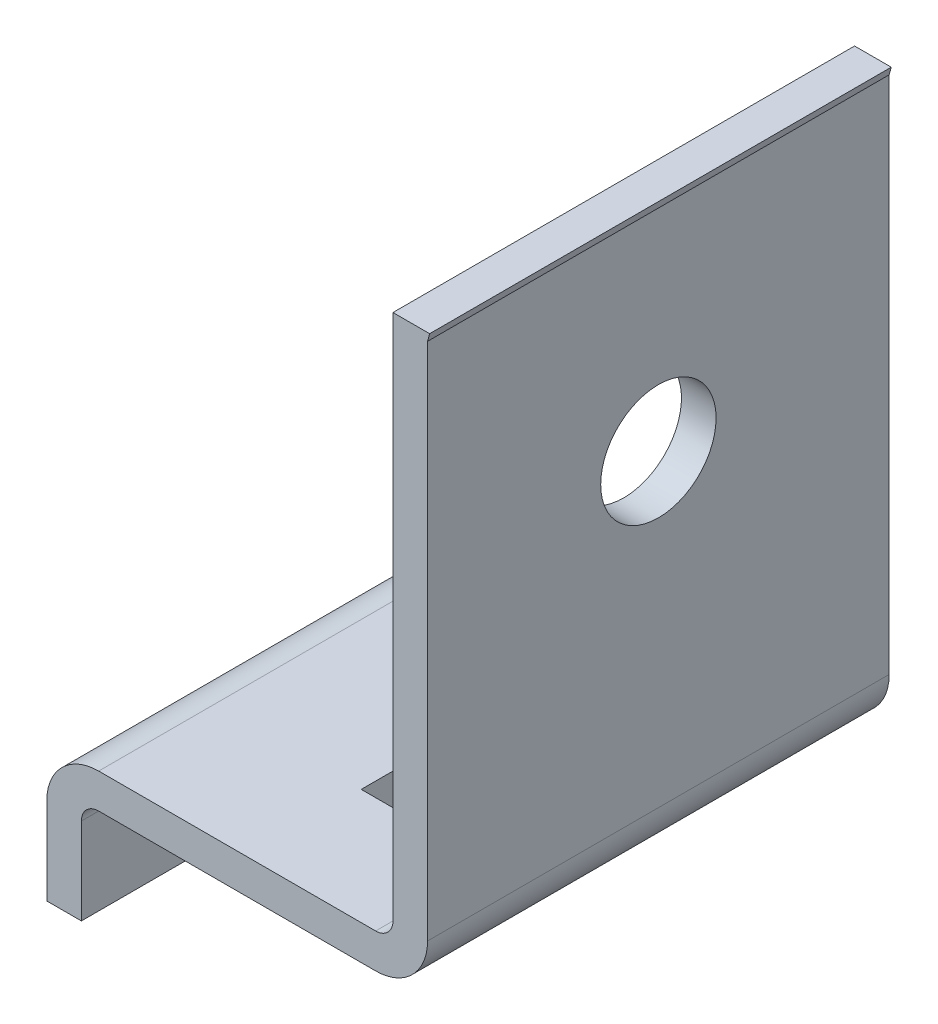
ISO-10303-21;
HEADER;
FILE_DESCRIPTION(('STEP AP214'),'2;1');
FILE_NAME('part.step','',(''),(''),'','','');
FILE_SCHEMA(('AUTOMOTIVE_DESIGN { 1 0 10303 214 1 1 1 1 }'));
ENDSEC;
DATA;
#1=APPLICATION_CONTEXT('core data for automotive mechanical design processes');
#2=APPLICATION_PROTOCOL_DEFINITION('international standard','automotive_design',2000,#1);
#3=PRODUCT_CONTEXT('',#1,'mechanical');
#4=PRODUCT('Part','Part','',(#3));
#5=PRODUCT_RELATED_PRODUCT_CATEGORY('part','',(#4));
#6=PRODUCT_DEFINITION_FORMATION('','',#4);
#7=PRODUCT_DEFINITION_CONTEXT('part definition',#1,'design');
#8=PRODUCT_DEFINITION('design','',#6,#7);
#9=PRODUCT_DEFINITION_SHAPE('','',#8);
#10=(LENGTH_UNIT() NAMED_UNIT(*) SI_UNIT(.MILLI.,.METRE.));
#11=(NAMED_UNIT(*) PLANE_ANGLE_UNIT() SI_UNIT($,.RADIAN.));
#12=(NAMED_UNIT(*) SI_UNIT($,.STERADIAN.) SOLID_ANGLE_UNIT());
#13=UNCERTAINTY_MEASURE_WITH_UNIT(LENGTH_MEASURE(1.E-05),#10,'distance_accuracy_value','');
#14=(GEOMETRIC_REPRESENTATION_CONTEXT(3) GLOBAL_UNCERTAINTY_ASSIGNED_CONTEXT((#13)) GLOBAL_UNIT_ASSIGNED_CONTEXT((#10,
#11,#12)) REPRESENTATION_CONTEXT('',''));
#15=CARTESIAN_POINT('',(0.,0.,0.));
#16=DIRECTION('',(0.,0.,1.));
#17=DIRECTION('',(1.,0.,0.));
#18=AXIS2_PLACEMENT_3D('',#15,#16,#17);
#19=CARTESIAN_POINT('',(0.,15.,-80.));
#20=DIRECTION('',(-1.,0.,0.));
#21=DIRECTION('',(0.,0.,1.));
#22=AXIS2_PLACEMENT_3D('',#19,#20,#21);
#23=PLANE('',#22);
#24=DIRECTION('',(0.,-1.,0.));
#25=VECTOR('',#24,1.);
#26=CARTESIAN_POINT('',(0.,15.,0.));
#27=LINE('',#26,#25);
#28=CARTESIAN_POINT('',(0.,15.,0.));
#29=VERTEX_POINT('',#28);
#30=CARTESIAN_POINT('',(0.,0.,0.));
#31=VERTEX_POINT('',#30);
#32=EDGE_CURVE('E286',#29,#31,#27,.T.);
#33=ORIENTED_EDGE('',*,*,#32,.F.);
#34=DIRECTION('',(0.,0.,1.));
#35=VECTOR('',#34,1.);
#36=CARTESIAN_POINT('',(0.,15.,-80.));
#37=LINE('',#36,#35);
#38=CARTESIAN_POINT('',(0.,15.,-80.));
#39=VERTEX_POINT('',#38);
#40=EDGE_CURVE('E187',#39,#29,#37,.T.);
#41=ORIENTED_EDGE('',*,*,#40,.F.);
#42=DIRECTION('',(0.,-1.,0.));
#43=VECTOR('',#42,1.);
#44=CARTESIAN_POINT('',(0.,0.,-80.));
#45=LINE('',#44,#43);
#46=CARTESIAN_POINT('',(0.,0.,-80.));
#47=VERTEX_POINT('',#46);
#48=EDGE_CURVE('E288',#39,#47,#45,.T.);
#49=ORIENTED_EDGE('',*,*,#48,.T.);
#50=DIRECTION('',(0.,0.,1.));
#51=VECTOR('',#50,1.);
#52=CARTESIAN_POINT('',(0.,0.,-80.));
#53=LINE('',#52,#51);
#54=EDGE_CURVE('E186',#47,#31,#53,.T.);
#55=ORIENTED_EDGE('',*,*,#54,.T.);
#56=EDGE_LOOP('',(#33,#41,#49,#55));
#57=FACE_BOUND('',#56,.T.);
#58=ADVANCED_FACE('F34',(#57),#23,.T.);
#59=CARTESIAN_POINT('',(9.,15.,-80.));
#60=DIRECTION('',(0.,0.,1.));
#61=DIRECTION('',(1.,0.,0.));
#62=AXIS2_PLACEMENT_3D('',#59,#60,#61);
#63=CYLINDRICAL_SURFACE('',#62,9.);
#64=CARTESIAN_POINT('',(9.,15.,0.));
#65=DIRECTION('',(0.,0.,1.));
#66=DIRECTION('',(1.,0.,0.));
#67=AXIS2_PLACEMENT_3D('',#64,#65,#66);
#68=CIRCLE('',#67,9.);
#69=CARTESIAN_POINT('',(9.,24.,0.));
#70=VERTEX_POINT('',#69);
#71=EDGE_CURVE('E283',#70,#29,#68,.T.);
#72=ORIENTED_EDGE('',*,*,#71,.F.);
#73=DIRECTION('',(0.,0.,1.));
#74=VECTOR('',#73,1.);
#75=CARTESIAN_POINT('',(9.,24.,-80.));
#76=LINE('',#75,#74);
#77=CARTESIAN_POINT('',(9.,24.,-80.));
#78=VERTEX_POINT('',#77);
#79=EDGE_CURVE('E190',#78,#70,#76,.T.);
#80=ORIENTED_EDGE('',*,*,#79,.F.);
#81=CARTESIAN_POINT('',(9.,15.,-80.));
#82=DIRECTION('',(0.,0.,1.));
#83=DIRECTION('',(1.,0.,0.));
#84=AXIS2_PLACEMENT_3D('',#81,#82,#83);
#85=CIRCLE('',#84,9.);
#86=EDGE_CURVE('E183',#78,#39,#85,.T.);
#87=ORIENTED_EDGE('',*,*,#86,.T.);
#88=ORIENTED_EDGE('',*,*,#40,.T.);
#89=EDGE_LOOP('',(#72,#80,#87,#88));
#90=FACE_BOUND('',#89,.T.);
#91=ADVANCED_FACE('F336',(#90),#63,.T.);
#92=CARTESIAN_POINT('',(12.0000000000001,24.,-80.));
#93=DIRECTION('',(0.,1.,0.));
#94=DIRECTION('',(0.,0.,1.));
#95=AXIS2_PLACEMENT_3D('',#92,#93,#94);
#96=PLANE('',#95);
#97=DIRECTION('',(0.,0.,-1.));
#98=VECTOR('',#97,1.);
#99=CARTESIAN_POINT('',(47.5,24.,-60.));
#100=LINE('',#99,#98);
#101=CARTESIAN_POINT('',(47.5,24.,-20.));
#102=VERTEX_POINT('',#101);
#103=CARTESIAN_POINT('',(47.5,24.,-60.));
#104=VERTEX_POINT('',#103);
#105=EDGE_CURVE('E56',#102,#104,#100,.T.);
#106=ORIENTED_EDGE('',*,*,#105,.F.);
#107=DIRECTION('',(1.,0.,0.));
#108=VECTOR('',#107,1.);
#109=CARTESIAN_POINT('',(47.5,24.,-20.));
#110=LINE('',#109,#108);
#111=CARTESIAN_POINT('',(34.5,24.,-20.));
#112=VERTEX_POINT('',#111);
#113=EDGE_CURVE('E236',#112,#102,#110,.T.);
#114=ORIENTED_EDGE('',*,*,#113,.F.);
#115=DIRECTION('',(0.,0.,1.));
#116=VECTOR('',#115,1.);
#117=CARTESIAN_POINT('',(34.5,24.,-60.));
#118=LINE('',#117,#116);
#119=CARTESIAN_POINT('',(34.5,24.,-60.));
#120=VERTEX_POINT('',#119);
#121=EDGE_CURVE('E248',#120,#112,#118,.T.);
#122=ORIENTED_EDGE('',*,*,#121,.F.);
#123=DIRECTION('',(-1.,0.,0.));
#124=VECTOR('',#123,1.);
#125=CARTESIAN_POINT('',(47.5,24.,-60.));
#126=LINE('',#125,#124);
#127=EDGE_CURVE('E495',#104,#120,#126,.T.);
#128=ORIENTED_EDGE('',*,*,#127,.F.);
#129=EDGE_LOOP('',(#106,#114,#122,#128));
#130=FACE_BOUND('',#129,.T.);
#131=DIRECTION('',(-1.,0.,0.));
#132=VECTOR('',#131,1.);
#133=CARTESIAN_POINT('',(12.0000000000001,24.,0.));
#134=LINE('',#133,#132);
#135=CARTESIAN_POINT('',(57.,24.,0.));
#136=VERTEX_POINT('',#135);
#137=EDGE_CURVE('E280',#136,#70,#134,.T.);
#138=ORIENTED_EDGE('',*,*,#137,.F.);
#139=DIRECTION('',(0.,0.,1.));
#140=VECTOR('',#139,1.);
#141=CARTESIAN_POINT('',(57.,24.,-80.));
#142=LINE('',#141,#140);
#143=CARTESIAN_POINT('',(57.,24.,-80.));
#144=VERTEX_POINT('',#143);
#145=EDGE_CURVE('E192',#144,#136,#142,.T.);
#146=ORIENTED_EDGE('',*,*,#145,.F.);
#147=DIRECTION('',(-1.,0.,0.));
#148=VECTOR('',#147,1.);
#149=CARTESIAN_POINT('',(48.,24.,-80.));
#150=LINE('',#149,#148);
#151=EDGE_CURVE('E176',#144,#78,#150,.T.);
#152=ORIENTED_EDGE('',*,*,#151,.T.);
#153=ORIENTED_EDGE('',*,*,#79,.T.);
#154=EDGE_LOOP('',(#138,#146,#152,#153));
#155=FACE_BOUND('',#154,.T.);
#156=ADVANCED_FACE('F338',(#130,#155),#96,.T.);
#157=CARTESIAN_POINT('',(57.,27.,-80.));
#158=DIRECTION('',(0.,0.,1.));
#159=DIRECTION('',(1.,0.,0.));
#160=AXIS2_PLACEMENT_3D('',#157,#158,#159);
#161=CYLINDRICAL_SURFACE('',#160,3.);
#162=CARTESIAN_POINT('',(57.,27.,0.));
#163=DIRECTION('',(0.,0.,-1.));
#164=DIRECTION('',(1.,0.,0.));
#165=AXIS2_PLACEMENT_3D('',#162,#163,#164);
#166=CIRCLE('',#165,3.);
#167=CARTESIAN_POINT('',(60.,27.,0.));
#168=VERTEX_POINT('',#167);
#169=EDGE_CURVE('E277',#168,#136,#166,.T.);
#170=ORIENTED_EDGE('',*,*,#169,.F.);
#171=DIRECTION('',(0.,0.,1.));
#172=VECTOR('',#171,1.);
#173=CARTESIAN_POINT('',(60.,27.,-80.));
#174=LINE('',#173,#172);
#175=CARTESIAN_POINT('',(60.,27.,-80.));
#176=VERTEX_POINT('',#175);
#177=EDGE_CURVE('E195',#176,#168,#174,.T.);
#178=ORIENTED_EDGE('',*,*,#177,.F.);
#179=CARTESIAN_POINT('',(57.,27.,-80.));
#180=DIRECTION('',(0.,0.,-1.));
#181=DIRECTION('',(1.,0.,0.));
#182=AXIS2_PLACEMENT_3D('',#179,#180,#181);
#183=CIRCLE('',#182,3.);
#184=EDGE_CURVE('E173',#176,#144,#183,.T.);
#185=ORIENTED_EDGE('',*,*,#184,.T.);
#186=ORIENTED_EDGE('',*,*,#145,.T.);
#187=EDGE_LOOP('',(#170,#178,#185,#186));
#188=FACE_BOUND('',#187,.T.);
#189=ADVANCED_FACE('F341',(#188),#161,.F.);
#190=CARTESIAN_POINT('',(60.,30.,-80.));
#191=DIRECTION('',(-1.,0.,0.));
#192=DIRECTION('',(0.,0.,1.));
#193=AXIS2_PLACEMENT_3D('',#190,#191,#192);
#194=PLANE('',#193);
#195=DIRECTION('',(0.,0.,1.));
#196=VECTOR('',#195,1.);
#197=CARTESIAN_POINT('',(60.,118.323036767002,-101.693495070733));
#198=LINE('',#197,#196);
#199=CARTESIAN_POINT('',(60.,118.323036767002,-80.));
#200=VERTEX_POINT('',#199);
#201=CARTESIAN_POINT('',(60.,118.323036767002,0.));
#202=VERTEX_POINT('',#201);
#203=EDGE_CURVE('E48',#200,#202,#198,.T.);
#204=ORIENTED_EDGE('',*,*,#203,.F.);
#205=DIRECTION('',(0.,-1.,0.));
#206=VECTOR('',#205,1.);
#207=CARTESIAN_POINT('',(60.,30.,-80.));
#208=LINE('',#207,#206);
#209=EDGE_CURVE('E165',#200,#176,#208,.T.);
#210=ORIENTED_EDGE('',*,*,#209,.T.);
#211=ORIENTED_EDGE('',*,*,#177,.T.);
#212=DIRECTION('',(0.,-1.,0.));
#213=VECTOR('',#212,1.);
#214=CARTESIAN_POINT('',(60.,30.,0.));
#215=LINE('',#214,#213);
#216=EDGE_CURVE('E167',#202,#168,#215,.T.);
#217=ORIENTED_EDGE('',*,*,#216,.F.);
#218=EDGE_LOOP('',(#204,#210,#211,#217));
#219=FACE_BOUND('',#218,.T.);
#220=CARTESIAN_POINT('',(60.,80.5,-40.));
#221=DIRECTION('',(-1.,0.,0.));
#222=DIRECTION('',(0.,0.,1.));
#223=AXIS2_PLACEMENT_3D('',#220,#221,#222);
#224=CIRCLE('',#223,10.);
#225=CARTESIAN_POINT('',(60.,80.5,-30.));
#226=VERTEX_POINT('',#225);
#227=EDGE_CURVE('E217',#226,#226,#224,.T.);
#228=ORIENTED_EDGE('',*,*,#227,.F.);
#229=EDGE_LOOP('',(#228));
#230=FACE_BOUND('',#229,.T.);
#231=ADVANCED_FACE('F162',(#219,#230),#194,.T.);
#232=CARTESIAN_POINT('',(66.,117.,-80.));
#233=DIRECTION('',(0.965925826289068,-0.258819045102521,0.));
#234=DIRECTION('',(0.258819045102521,0.965925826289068,0.));
#235=AXIS2_PLACEMENT_3D('',#232,#233,#234);
#236=PLANE('',#235);
#237=DIRECTION('',(0.,0.,-1.));
#238=VECTOR('',#237,1.);
#239=CARTESIAN_POINT('',(66.3545066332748,118.323036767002,-80.));
#240=LINE('',#239,#238);
#241=CARTESIAN_POINT('',(66.3545066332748,118.323036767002,0.));
#242=VERTEX_POINT('',#241);
#243=CARTESIAN_POINT('',(66.3545066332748,118.323036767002,-80.));
#244=VERTEX_POINT('',#243);
#245=EDGE_CURVE('E154',#242,#244,#240,.T.);
#246=ORIENTED_EDGE('',*,*,#245,.F.);
#247=DIRECTION('',(0.258819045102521,0.965925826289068,0.));
#248=VECTOR('',#247,1.);
#249=CARTESIAN_POINT('',(66.,117.,0.));
#250=LINE('',#249,#248);
#251=CARTESIAN_POINT('',(66.,117.,0.));
#252=VERTEX_POINT('',#251);
#253=EDGE_CURVE('E273',#252,#242,#250,.T.);
#254=ORIENTED_EDGE('',*,*,#253,.F.);
#255=DIRECTION('',(0.,0.,1.));
#256=VECTOR('',#255,1.);
#257=CARTESIAN_POINT('',(66.,117.,-80.));
#258=LINE('',#257,#256);
#259=CARTESIAN_POINT('',(66.,117.,-80.));
#260=VERTEX_POINT('',#259);
#261=EDGE_CURVE('E197',#260,#252,#258,.T.);
#262=ORIENTED_EDGE('',*,*,#261,.F.);
#263=DIRECTION('',(0.258819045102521,0.965925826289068,0.));
#264=VECTOR('',#263,1.);
#265=CARTESIAN_POINT('',(66.,117.,-80.));
#266=LINE('',#265,#264);
#267=EDGE_CURVE('E174',#260,#244,#266,.T.);
#268=ORIENTED_EDGE('',*,*,#267,.T.);
#269=EDGE_LOOP('',(#246,#254,#262,#268));
#270=FACE_BOUND('',#269,.T.);
#271=ADVANCED_FACE('F311',(#270),#236,.T.);
#272=CARTESIAN_POINT('',(66.,30.0000000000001,-80.));
#273=DIRECTION('',(1.,0.,0.));
#274=DIRECTION('',(0.,0.,-1.));
#275=AXIS2_PLACEMENT_3D('',#272,#273,#274);
#276=PLANE('',#275);
#277=CARTESIAN_POINT('',(66.,80.5,-40.));
#278=DIRECTION('',(1.,0.,0.));
#279=DIRECTION('',(0.,0.,-1.));
#280=AXIS2_PLACEMENT_3D('',#277,#278,#279);
#281=CIRCLE('',#280,10.);
#282=CARTESIAN_POINT('',(66.,80.5,-50.));
#283=VERTEX_POINT('',#282);
#284=EDGE_CURVE('E213',#283,#283,#281,.T.);
#285=ORIENTED_EDGE('',*,*,#284,.F.);
#286=EDGE_LOOP('',(#285));
#287=FACE_BOUND('',#286,.T.);
#288=DIRECTION('',(0.,1.,0.));
#289=VECTOR('',#288,1.);
#290=CARTESIAN_POINT('',(66.,30.0000000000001,0.));
#291=LINE('',#290,#289);
#292=CARTESIAN_POINT('',(66.,27.,0.));
#293=VERTEX_POINT('',#292);
#294=EDGE_CURVE('E270',#293,#252,#291,.T.);
#295=ORIENTED_EDGE('',*,*,#294,.F.);
#296=DIRECTION('',(0.,0.,1.));
#297=VECTOR('',#296,1.);
#298=CARTESIAN_POINT('',(66.,27.,-80.));
#299=LINE('',#298,#297);
#300=CARTESIAN_POINT('',(66.,27.,-80.));
#301=VERTEX_POINT('',#300);
#302=EDGE_CURVE('E199',#301,#293,#299,.T.);
#303=ORIENTED_EDGE('',*,*,#302,.F.);
#304=DIRECTION('',(0.,1.,0.));
#305=VECTOR('',#304,1.);
#306=CARTESIAN_POINT('',(66.,30.0000000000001,-80.));
#307=LINE('',#306,#305);
#308=EDGE_CURVE('E178',#301,#260,#307,.T.);
#309=ORIENTED_EDGE('',*,*,#308,.T.);
#310=ORIENTED_EDGE('',*,*,#261,.T.);
#311=EDGE_LOOP('',(#295,#303,#309,#310));
#312=FACE_BOUND('',#311,.T.);
#313=ADVANCED_FACE('F307',(#287,#312),#276,.T.);
#314=CARTESIAN_POINT('',(57.,27.,-80.));
#315=DIRECTION('',(0.,0.,1.));
#316=DIRECTION('',(1.,0.,0.));
#317=AXIS2_PLACEMENT_3D('',#314,#315,#316);
#318=CYLINDRICAL_SURFACE('',#317,9.);
#319=CARTESIAN_POINT('',(57.,27.,0.));
#320=DIRECTION('',(0.,0.,1.));
#321=DIRECTION('',(1.,0.,0.));
#322=AXIS2_PLACEMENT_3D('',#319,#320,#321);
#323=CIRCLE('',#322,9.);
#324=CARTESIAN_POINT('',(57.,18.,0.));
#325=VERTEX_POINT('',#324);
#326=EDGE_CURVE('E267',#325,#293,#323,.T.);
#327=ORIENTED_EDGE('',*,*,#326,.F.);
#328=DIRECTION('',(0.,0.,1.));
#329=VECTOR('',#328,1.);
#330=CARTESIAN_POINT('',(57.,18.,-80.));
#331=LINE('',#330,#329);
#332=CARTESIAN_POINT('',(57.,18.,-80.));
#333=VERTEX_POINT('',#332);
#334=EDGE_CURVE('E202',#333,#325,#331,.T.);
#335=ORIENTED_EDGE('',*,*,#334,.F.);
#336=CARTESIAN_POINT('',(57.,27.,-80.));
#337=DIRECTION('',(0.,0.,1.));
#338=DIRECTION('',(1.,0.,0.));
#339=AXIS2_PLACEMENT_3D('',#336,#337,#338);
#340=CIRCLE('',#339,9.);
#341=EDGE_CURVE('E302',#333,#301,#340,.T.);
#342=ORIENTED_EDGE('',*,*,#341,.T.);
#343=ORIENTED_EDGE('',*,*,#302,.T.);
#344=EDGE_LOOP('',(#327,#335,#342,#343));
#345=FACE_BOUND('',#344,.T.);
#346=ADVANCED_FACE('F316',(#345),#318,.T.);
#347=CARTESIAN_POINT('',(9.,18.,-80.));
#348=DIRECTION('',(0.,-1.,0.));
#349=DIRECTION('',(1.,0.,0.));
#350=AXIS2_PLACEMENT_3D('',#347,#348,#349);
#351=PLANE('',#350);
#352=DIRECTION('',(0.,0.,1.));
#353=VECTOR('',#352,1.);
#354=CARTESIAN_POINT('',(47.5,18.,-80.));
#355=LINE('',#354,#353);
#356=CARTESIAN_POINT('',(47.5,18.,-60.));
#357=VERTEX_POINT('',#356);
#358=CARTESIAN_POINT('',(47.5,18.,-20.));
#359=VERTEX_POINT('',#358);
#360=EDGE_CURVE('E42',#357,#359,#355,.T.);
#361=ORIENTED_EDGE('',*,*,#360,.F.);
#362=DIRECTION('',(1.,0.,0.));
#363=VECTOR('',#362,1.);
#364=CARTESIAN_POINT('',(9.,18.,-60.));
#365=LINE('',#364,#363);
#366=CARTESIAN_POINT('',(34.5,18.,-60.));
#367=VERTEX_POINT('',#366);
#368=EDGE_CURVE('E189',#367,#357,#365,.T.);
#369=ORIENTED_EDGE('',*,*,#368,.F.);
#370=DIRECTION('',(0.,0.,-1.));
#371=VECTOR('',#370,1.);
#372=CARTESIAN_POINT('',(34.5,18.,-80.));
#373=LINE('',#372,#371);
#374=CARTESIAN_POINT('',(34.5,18.,-20.));
#375=VERTEX_POINT('',#374);
#376=EDGE_CURVE('E219',#375,#367,#373,.T.);
#377=ORIENTED_EDGE('',*,*,#376,.F.);
#378=DIRECTION('',(-1.,0.,0.));
#379=VECTOR('',#378,1.);
#380=CARTESIAN_POINT('',(8.99999999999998,18.,-20.));
#381=LINE('',#380,#379);
#382=EDGE_CURVE('E222',#359,#375,#381,.T.);
#383=ORIENTED_EDGE('',*,*,#382,.F.);
#384=EDGE_LOOP('',(#361,#369,#377,#383));
#385=FACE_BOUND('',#384,.T.);
#386=DIRECTION('',(1.,0.,0.));
#387=VECTOR('',#386,1.);
#388=CARTESIAN_POINT('',(9.,18.,0.));
#389=LINE('',#388,#387);
#390=CARTESIAN_POINT('',(9.,18.,0.));
#391=VERTEX_POINT('',#390);
#392=EDGE_CURVE('E264',#391,#325,#389,.T.);
#393=ORIENTED_EDGE('',*,*,#392,.F.);
#394=DIRECTION('',(0.,0.,1.));
#395=VECTOR('',#394,1.);
#396=CARTESIAN_POINT('',(9.,18.,-80.));
#397=LINE('',#396,#395);
#398=CARTESIAN_POINT('',(9.,18.,-80.));
#399=VERTEX_POINT('',#398);
#400=EDGE_CURVE('E204',#399,#391,#397,.T.);
#401=ORIENTED_EDGE('',*,*,#400,.F.);
#402=DIRECTION('',(1.,0.,0.));
#403=VECTOR('',#402,1.);
#404=CARTESIAN_POINT('',(9.,18.,-80.));
#405=LINE('',#404,#403);
#406=EDGE_CURVE('E299',#399,#333,#405,.T.);
#407=ORIENTED_EDGE('',*,*,#406,.T.);
#408=ORIENTED_EDGE('',*,*,#334,.T.);
#409=EDGE_LOOP('',(#393,#401,#407,#408));
#410=FACE_BOUND('',#409,.T.);
#411=ADVANCED_FACE('F240',(#385,#410),#351,.T.);
#412=CARTESIAN_POINT('',(9.,15.,-80.));
#413=DIRECTION('',(0.,0.,1.));
#414=DIRECTION('',(1.,0.,0.));
#415=AXIS2_PLACEMENT_3D('',#412,#413,#414);
#416=CYLINDRICAL_SURFACE('',#415,2.99999999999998);
#417=CARTESIAN_POINT('',(9.,15.,0.));
#418=DIRECTION('',(0.,0.,-1.));
#419=DIRECTION('',(1.,0.,0.));
#420=AXIS2_PLACEMENT_3D('',#417,#418,#419);
#421=CIRCLE('',#420,2.99999999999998);
#422=CARTESIAN_POINT('',(6.,15.,0.));
#423=VERTEX_POINT('',#422);
#424=EDGE_CURVE('E261',#423,#391,#421,.T.);
#425=ORIENTED_EDGE('',*,*,#424,.F.);
#426=DIRECTION('',(0.,0.,1.));
#427=VECTOR('',#426,1.);
#428=CARTESIAN_POINT('',(6.,15.,-80.));
#429=LINE('',#428,#427);
#430=CARTESIAN_POINT('',(6.,15.,-80.));
#431=VERTEX_POINT('',#430);
#432=EDGE_CURVE('E206',#431,#423,#429,.T.);
#433=ORIENTED_EDGE('',*,*,#432,.F.);
#434=CARTESIAN_POINT('',(9.,15.,-80.));
#435=DIRECTION('',(0.,0.,-1.));
#436=DIRECTION('',(1.,0.,0.));
#437=AXIS2_PLACEMENT_3D('',#434,#435,#436);
#438=CIRCLE('',#437,2.99999999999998);
#439=EDGE_CURVE('E296',#431,#399,#438,.T.);
#440=ORIENTED_EDGE('',*,*,#439,.T.);
#441=ORIENTED_EDGE('',*,*,#400,.T.);
#442=EDGE_LOOP('',(#425,#433,#440,#441));
#443=FACE_BOUND('',#442,.T.);
#444=ADVANCED_FACE('F322',(#443),#416,.F.);
#445=CARTESIAN_POINT('',(6.,15.,-80.));
#446=DIRECTION('',(1.,0.,0.));
#447=DIRECTION('',(0.,1.,0.));
#448=AXIS2_PLACEMENT_3D('',#445,#446,#447);
#449=PLANE('',#448);
#450=DIRECTION('',(0.,1.,0.));
#451=VECTOR('',#450,1.);
#452=CARTESIAN_POINT('',(6.,15.,0.));
#453=LINE('',#452,#451);
#454=CARTESIAN_POINT('',(6.,0.,0.));
#455=VERTEX_POINT('',#454);
#456=EDGE_CURVE('E258',#455,#423,#453,.T.);
#457=ORIENTED_EDGE('',*,*,#456,.F.);
#458=DIRECTION('',(0.,0.,1.));
#459=VECTOR('',#458,1.);
#460=CARTESIAN_POINT('',(6.,0.,-80.));
#461=LINE('',#460,#459);
#462=CARTESIAN_POINT('',(6.,0.,-80.));
#463=VERTEX_POINT('',#462);
#464=EDGE_CURVE('E208',#463,#455,#461,.T.);
#465=ORIENTED_EDGE('',*,*,#464,.F.);
#466=DIRECTION('',(0.,1.,0.));
#467=VECTOR('',#466,1.);
#468=CARTESIAN_POINT('',(6.,0.,-80.));
#469=LINE('',#468,#467);
#470=EDGE_CURVE('E294',#463,#431,#469,.T.);
#471=ORIENTED_EDGE('',*,*,#470,.T.);
#472=ORIENTED_EDGE('',*,*,#432,.T.);
#473=EDGE_LOOP('',(#457,#465,#471,#472));
#474=FACE_BOUND('',#473,.T.);
#475=ADVANCED_FACE('F342',(#474),#449,.T.);
#476=CARTESIAN_POINT('',(0.,0.,-80.));
#477=DIRECTION('',(0.,-1.,0.));
#478=DIRECTION('',(0.,0.,-1.));
#479=AXIS2_PLACEMENT_3D('',#476,#477,#478);
#480=PLANE('',#479);
#481=DIRECTION('',(1.,0.,0.));
#482=VECTOR('',#481,1.);
#483=CARTESIAN_POINT('',(0.,0.,0.));
#484=LINE('',#483,#482);
#485=EDGE_CURVE('E216',#31,#455,#484,.T.);
#486=ORIENTED_EDGE('',*,*,#485,.F.);
#487=ORIENTED_EDGE('',*,*,#54,.F.);
#488=DIRECTION('',(1.,0.,0.));
#489=VECTOR('',#488,1.);
#490=CARTESIAN_POINT('',(0.,0.,-80.));
#491=LINE('',#490,#489);
#492=EDGE_CURVE('E291',#47,#463,#491,.T.);
#493=ORIENTED_EDGE('',*,*,#492,.T.);
#494=ORIENTED_EDGE('',*,*,#464,.T.);
#495=EDGE_LOOP('',(#486,#487,#493,#494));
#496=FACE_BOUND('',#495,.T.);
#497=ADVANCED_FACE('F36',(#496),#480,.T.);
#498=CARTESIAN_POINT('',(9.,15.,-80.));
#499=DIRECTION('',(0.,0.,1.));
#500=DIRECTION('',(1.,0.,0.));
#501=AXIS2_PLACEMENT_3D('',#498,#499,#500);
#502=PLANE('',#501);
#503=ORIENTED_EDGE('',*,*,#209,.F.);
#504=DIRECTION('',(1.,0.,0.));
#505=VECTOR('',#504,1.);
#506=CARTESIAN_POINT('',(9.,118.323036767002,-80.));
#507=LINE('',#506,#505);
#508=EDGE_CURVE('E151',#200,#244,#507,.T.);
#509=ORIENTED_EDGE('',*,*,#508,.T.);
#510=ORIENTED_EDGE('',*,*,#267,.F.);
#511=ORIENTED_EDGE('',*,*,#308,.F.);
#512=ORIENTED_EDGE('',*,*,#341,.F.);
#513=ORIENTED_EDGE('',*,*,#406,.F.);
#514=ORIENTED_EDGE('',*,*,#439,.F.);
#515=ORIENTED_EDGE('',*,*,#470,.F.);
#516=ORIENTED_EDGE('',*,*,#492,.F.);
#517=ORIENTED_EDGE('',*,*,#48,.F.);
#518=ORIENTED_EDGE('',*,*,#86,.F.);
#519=ORIENTED_EDGE('',*,*,#151,.F.);
#520=ORIENTED_EDGE('',*,*,#184,.F.);
#521=EDGE_LOOP('',(#503,#509,#510,#511,#512,#513,#514,#515,#516,#517,#518,#519,#520));
#522=FACE_BOUND('',#521,.T.);
#523=ADVANCED_FACE('F170',(#522),#502,.F.);
#524=CARTESIAN_POINT('',(9.,15.,0.));
#525=DIRECTION('',(0.,0.,1.));
#526=DIRECTION('',(1.,0.,0.));
#527=AXIS2_PLACEMENT_3D('',#524,#525,#526);
#528=PLANE('',#527);
#529=DIRECTION('',(1.,0.,0.));
#530=VECTOR('',#529,1.);
#531=CARTESIAN_POINT('',(9.,118.323036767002,0.));
#532=LINE('',#531,#530);
#533=EDGE_CURVE('E12',#202,#242,#532,.T.);
#534=ORIENTED_EDGE('',*,*,#533,.F.);
#535=ORIENTED_EDGE('',*,*,#216,.T.);
#536=ORIENTED_EDGE('',*,*,#169,.T.);
#537=ORIENTED_EDGE('',*,*,#137,.T.);
#538=ORIENTED_EDGE('',*,*,#71,.T.);
#539=ORIENTED_EDGE('',*,*,#32,.T.);
#540=ORIENTED_EDGE('',*,*,#485,.T.);
#541=ORIENTED_EDGE('',*,*,#456,.T.);
#542=ORIENTED_EDGE('',*,*,#424,.T.);
#543=ORIENTED_EDGE('',*,*,#392,.T.);
#544=ORIENTED_EDGE('',*,*,#326,.T.);
#545=ORIENTED_EDGE('',*,*,#294,.T.);
#546=ORIENTED_EDGE('',*,*,#253,.T.);
#547=EDGE_LOOP('',(#534,#535,#536,#537,#538,#539,#540,#541,#542,#543,#544,#545,#546));
#548=FACE_BOUND('',#547,.T.);
#549=ADVANCED_FACE('F313',(#548),#528,.T.);
#550=CARTESIAN_POINT('',(70.,80.5,-40.));
#551=DIRECTION('',(-1.,0.,0.));
#552=DIRECTION('',(0.,0.,1.));
#553=AXIS2_PLACEMENT_3D('',#550,#551,#552);
#554=CYLINDRICAL_SURFACE('',#553,10.);
#555=ORIENTED_EDGE('',*,*,#284,.T.);
#556=EDGE_LOOP('',(#555));
#557=FACE_BOUND('',#556,.T.);
#558=ORIENTED_EDGE('',*,*,#227,.T.);
#559=EDGE_LOOP('',(#558));
#560=FACE_BOUND('',#559,.T.);
#561=ADVANCED_FACE('F411',(#557,#560),#554,.F.);
#562=CARTESIAN_POINT('',(47.5,14.,-60.));
#563=DIRECTION('',(1.,0.,0.));
#564=DIRECTION('',(0.,0.,-1.));
#565=AXIS2_PLACEMENT_3D('',#562,#563,#564);
#566=PLANE('',#565);
#567=ORIENTED_EDGE('',*,*,#360,.T.);
#568=DIRECTION('',(0.,1.,0.));
#569=VECTOR('',#568,1.);
#570=CARTESIAN_POINT('',(47.5,14.,-20.));
#571=LINE('',#570,#569);
#572=EDGE_CURVE('E226',#359,#102,#571,.T.);
#573=ORIENTED_EDGE('',*,*,#572,.T.);
#574=ORIENTED_EDGE('',*,*,#105,.T.);
#575=DIRECTION('',(0.,1.,0.));
#576=VECTOR('',#575,1.);
#577=CARTESIAN_POINT('',(47.5,14.,-60.));
#578=LINE('',#577,#576);
#579=EDGE_CURVE('E228',#357,#104,#578,.T.);
#580=ORIENTED_EDGE('',*,*,#579,.F.);
#581=EDGE_LOOP('',(#567,#573,#574,#580));
#582=FACE_BOUND('',#581,.T.);
#583=ADVANCED_FACE('F225',(#582),#566,.F.);
#584=CARTESIAN_POINT('',(47.5,14.,-20.));
#585=DIRECTION('',(0.,0.,1.));
#586=DIRECTION('',(1.,0.,0.));
#587=AXIS2_PLACEMENT_3D('',#584,#585,#586);
#588=PLANE('',#587);
#589=ORIENTED_EDGE('',*,*,#382,.T.);
#590=DIRECTION('',(0.,1.,0.));
#591=VECTOR('',#590,1.);
#592=CARTESIAN_POINT('',(34.5,14.,-20.));
#593=LINE('',#592,#591);
#594=EDGE_CURVE('E237',#375,#112,#593,.T.);
#595=ORIENTED_EDGE('',*,*,#594,.T.);
#596=ORIENTED_EDGE('',*,*,#113,.T.);
#597=ORIENTED_EDGE('',*,*,#572,.F.);
#598=EDGE_LOOP('',(#589,#595,#596,#597));
#599=FACE_BOUND('',#598,.T.);
#600=ADVANCED_FACE('F233',(#599),#588,.F.);
#601=CARTESIAN_POINT('',(34.5,14.,-60.));
#602=DIRECTION('',(-1.,0.,0.));
#603=DIRECTION('',(0.,0.,1.));
#604=AXIS2_PLACEMENT_3D('',#601,#602,#603);
#605=PLANE('',#604);
#606=ORIENTED_EDGE('',*,*,#376,.T.);
#607=DIRECTION('',(0.,1.,0.));
#608=VECTOR('',#607,1.);
#609=CARTESIAN_POINT('',(34.5,14.,-60.));
#610=LINE('',#609,#608);
#611=EDGE_CURVE('E245',#367,#120,#610,.T.);
#612=ORIENTED_EDGE('',*,*,#611,.T.);
#613=ORIENTED_EDGE('',*,*,#121,.T.);
#614=ORIENTED_EDGE('',*,*,#594,.F.);
#615=EDGE_LOOP('',(#606,#612,#613,#614));
#616=FACE_BOUND('',#615,.T.);
#617=ADVANCED_FACE('F243',(#616),#605,.F.);
#618=CARTESIAN_POINT('',(47.5,14.,-60.));
#619=DIRECTION('',(0.,0.,-1.));
#620=DIRECTION('',(-1.,0.,0.));
#621=AXIS2_PLACEMENT_3D('',#618,#619,#620);
#622=PLANE('',#621);
#623=ORIENTED_EDGE('',*,*,#368,.T.);
#624=ORIENTED_EDGE('',*,*,#579,.T.);
#625=ORIENTED_EDGE('',*,*,#127,.T.);
#626=ORIENTED_EDGE('',*,*,#611,.F.);
#627=EDGE_LOOP('',(#623,#624,#625,#626));
#628=FACE_BOUND('',#627,.T.);
#629=ADVANCED_FACE('F460',(#628),#622,.F.);
#630=CARTESIAN_POINT('',(84.7643807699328,118.323036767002,-101.693495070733));
#631=DIRECTION('',(0.,-1.,0.));
#632=DIRECTION('',(0.,0.,-1.));
#633=AXIS2_PLACEMENT_3D('',#630,#631,#632);
#634=PLANE('',#633);
#635=ORIENTED_EDGE('',*,*,#203,.T.);
#636=ORIENTED_EDGE('',*,*,#533,.T.);
#637=ORIENTED_EDGE('',*,*,#245,.T.);
#638=ORIENTED_EDGE('',*,*,#508,.F.);
#639=EDGE_LOOP('',(#635,#636,#637,#638));
#640=FACE_BOUND('',#639,.T.);
#641=ADVANCED_FACE('F152',(#640),#634,.F.);
#642=CLOSED_SHELL('',(#58,#91,#156,#189,#231,#271,#313,#346,#411,#444,#475,#497,#523,#549,#561,
#583,#600,#617,#629,#641));
#643=MANIFOLD_SOLID_BREP('B2',#642);
#644=ADVANCED_BREP_SHAPE_REPRESENTATION('',(#18,#643),#14);
#645=SHAPE_DEFINITION_REPRESENTATION(#9,#644);
ENDSEC;
END-ISO-10303-21;
